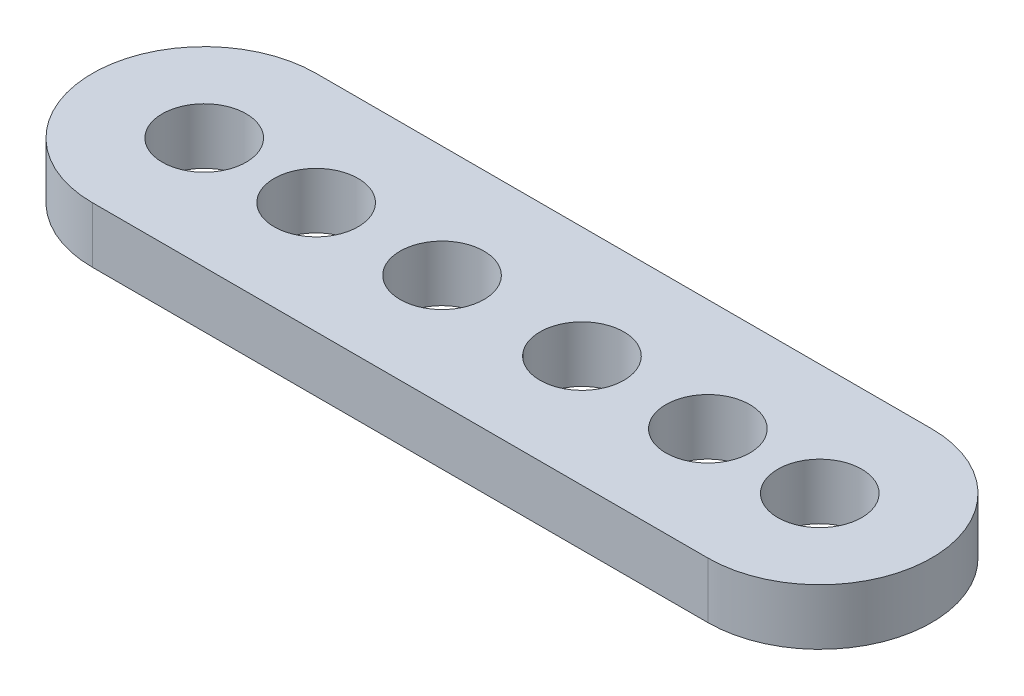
from build123d import *

# Parameters (mm, degrees)
SKETCH_2_R      = 1.5
EXTRUDE_1_DEPTH = 2


with BuildPart() as part:
    # Sketch 2 → Extrude 1 (new body)
    with BuildSketch(Plane(origin=(0, 0, 0), x_dir=(1, 0, 0), z_dir=(0, 1, 0))):
        with BuildLine():
            Line((0, 4), (22, 4))
            ThreePointArc((22, 4), (26, 0), (22, -4))
            Line((22, -4), (0, -4))
            ThreePointArc((0, -4), (-4, 0), (0, 4))
        make_face()
        with Locations(Location((0, 0, 0), (0, 0, 270))):
            Circle(SKETCH_2_R, mode=Mode.SUBTRACT)
        with Locations(Location((4, 0, 0), (0, 0, 270))):
            Circle(SKETCH_2_R, mode=Mode.SUBTRACT)
        with Locations(Location((8.5, 0, 0), (0, 0, 270))):
            Circle(SKETCH_2_R, mode=Mode.SUBTRACT)
        with Locations(Location((13.5, 0, 0), (0, 0, 270))):
            Circle(SKETCH_2_R, mode=Mode.SUBTRACT)
        with Locations(Location((18, 0, 0), (0, 0, 270))):
            Circle(SKETCH_2_R, mode=Mode.SUBTRACT)
        with Locations(Location((22, 0, 0), (0, 0, 270))):
            Circle(SKETCH_2_R, mode=Mode.SUBTRACT)
    extrude(amount=EXTRUDE_1_DEPTH)


solid = part.part
